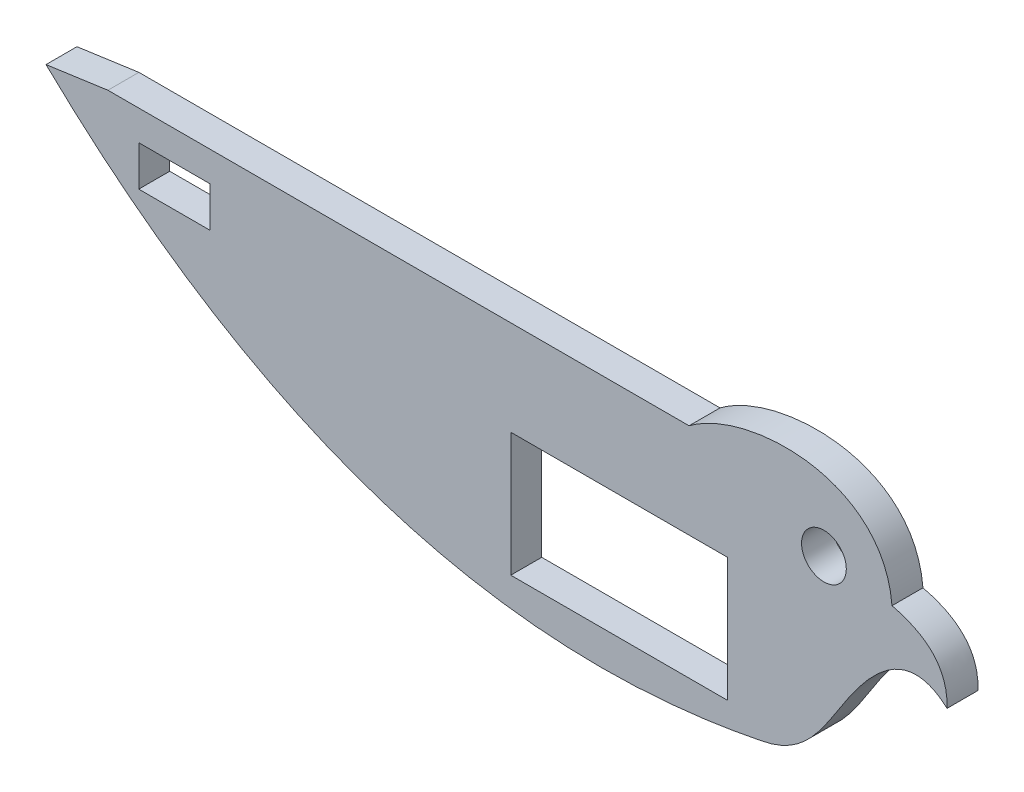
ISO-10303-21;
HEADER;
FILE_DESCRIPTION(('STEP AP214'),'2;1');
FILE_NAME('part.step','',(''),(''),'','','');
FILE_SCHEMA(('AUTOMOTIVE_DESIGN { 1 0 10303 214 1 1 1 1 }'));
ENDSEC;
DATA;
#1=APPLICATION_CONTEXT('core data for automotive mechanical design processes');
#2=APPLICATION_PROTOCOL_DEFINITION('international standard','automotive_design',2000,#1);
#3=PRODUCT_CONTEXT('',#1,'mechanical');
#4=PRODUCT('Part','Part','',(#3));
#5=PRODUCT_RELATED_PRODUCT_CATEGORY('part','',(#4));
#6=PRODUCT_DEFINITION_FORMATION('','',#4);
#7=PRODUCT_DEFINITION_CONTEXT('part definition',#1,'design');
#8=PRODUCT_DEFINITION('design','',#6,#7);
#9=PRODUCT_DEFINITION_SHAPE('','',#8);
#10=(LENGTH_UNIT() NAMED_UNIT(*) SI_UNIT(.MILLI.,.METRE.));
#11=(NAMED_UNIT(*) PLANE_ANGLE_UNIT() SI_UNIT($,.RADIAN.));
#12=(NAMED_UNIT(*) SI_UNIT($,.STERADIAN.) SOLID_ANGLE_UNIT());
#13=UNCERTAINTY_MEASURE_WITH_UNIT(LENGTH_MEASURE(1.E-05),#10,'distance_accuracy_value','');
#14=(GEOMETRIC_REPRESENTATION_CONTEXT(3) GLOBAL_UNCERTAINTY_ASSIGNED_CONTEXT((#13)) GLOBAL_UNIT_ASSIGNED_CONTEXT((#10,
#11,#12)) REPRESENTATION_CONTEXT('',''));
#15=CARTESIAN_POINT('',(0.,0.,0.));
#16=DIRECTION('',(0.,0.,1.));
#17=DIRECTION('',(1.,0.,0.));
#18=AXIS2_PLACEMENT_3D('',#15,#16,#17);
#19=CARTESIAN_POINT('',(161.005913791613,2.48033699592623,5.));
#20=DIRECTION('',(0.,0.,1.));
#21=DIRECTION('',(1.,0.,0.));
#22=AXIS2_PLACEMENT_3D('',#19,#20,#21);
#23=PLANE('',#22);
#24=CARTESIAN_POINT('',(165.191064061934,-10.1776352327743,5.));
#25=CARTESIAN_POINT('',(165.705391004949,5.21885500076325,5.));
#26=CARTESIAN_POINT('',(147.421809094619,9.66127321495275,5.));
#27=B_SPLINE_CURVE_WITH_KNOTS('',2,(#24,#25,#26),.UNSPECIFIED.,.F.,.F.,(3,3),(0.,1.),.UNSPECIFIED.);
#28=CARTESIAN_POINT('',(165.191064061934,-10.1776352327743,5.));
#29=VERTEX_POINT('',#28);
#30=CARTESIAN_POINT('',(147.421809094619,9.66127321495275,5.));
#31=VERTEX_POINT('',#30);
#32=EDGE_CURVE('E240',#29,#31,#27,.T.);
#33=ORIENTED_EDGE('',*,*,#32,.T.);
#34=CARTESIAN_POINT('',(147.421809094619,9.66127321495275,5.));
#35=CARTESIAN_POINT('',(144.59292128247,42.2587609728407,5.));
#36=CARTESIAN_POINT('',(101.517598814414,41.9344295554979,5.));
#37=CARTESIAN_POINT('',(81.8764686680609,27.2192570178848,5.));
#38=B_SPLINE_CURVE_WITH_KNOTS('',3,(#34,#35,#36,#37),.UNSPECIFIED.,.F.,.F.,(4,4),(0.,1.),.UNSPECIFIED.);
#39=CARTESIAN_POINT('',(81.8764686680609,27.2192570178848,5.));
#40=VERTEX_POINT('',#39);
#41=EDGE_CURVE('E247',#31,#40,#38,.T.);
#42=ORIENTED_EDGE('',*,*,#41,.T.);
#43=DIRECTION('',(-1.,0.,0.));
#44=VECTOR('',#43,1.);
#45=CARTESIAN_POINT('',(81.8764686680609,27.2192570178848,5.));
#46=LINE('',#45,#44);
#47=CARTESIAN_POINT('',(-105.830999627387,27.2192570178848,5.));
#48=VERTEX_POINT('',#47);
#49=EDGE_CURVE('E257',#40,#48,#46,.T.);
#50=ORIENTED_EDGE('',*,*,#49,.T.);
#51=DIRECTION('',(-0.990216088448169,-0.139542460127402,0.));
#52=VECTOR('',#51,1.);
#53=CARTESIAN_POINT('',(-125.830999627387,24.4008326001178,5.));
#54=LINE('',#53,#52);
#55=CARTESIAN_POINT('',(-125.830999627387,24.4008326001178,5.));
#56=VERTEX_POINT('',#55);
#57=EDGE_CURVE('E288',#48,#56,#54,.T.);
#58=ORIENTED_EDGE('',*,*,#57,.T.);
#59=CARTESIAN_POINT('',(-125.830999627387,24.4008326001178,5.));
#60=CARTESIAN_POINT('',(-22.4431846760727,-75.1159253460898,5.));
#61=CARTESIAN_POINT('',(105.072009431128,-49.2513335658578,5.));
#62=B_SPLINE_CURVE_WITH_KNOTS('',2,(#59,#60,#61),.UNSPECIFIED.,.F.,.F.,(3,3),(0.,1.),.UNSPECIFIED.);
#63=CARTESIAN_POINT('',(105.072009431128,-49.2513335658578,5.));
#64=VERTEX_POINT('',#63);
#65=EDGE_CURVE('E282',#56,#64,#62,.T.);
#66=ORIENTED_EDGE('',*,*,#65,.T.);
#67=CARTESIAN_POINT('',(105.072009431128,-49.2513335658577,5.));
#68=CARTESIAN_POINT('',(121.64455433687,-46.2763371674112,5.));
#69=CARTESIAN_POINT('',(130.107372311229,-21.4933885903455,5.));
#70=CARTESIAN_POINT('',(153.889230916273,0.0672267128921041,5.));
#71=CARTESIAN_POINT('',(165.191064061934,-10.1776352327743,5.));
#72=B_SPLINE_CURVE_WITH_KNOTS('',3,(#67,#68,#69,#70,#71),.UNSPECIFIED.,.F.,.F.,(4,1,4),(0.,
0.557492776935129,1.),.UNSPECIFIED.);
#73=EDGE_CURVE('E287',#64,#29,#72,.T.);
#74=ORIENTED_EDGE('',*,*,#73,.T.);
#75=EDGE_LOOP('',(#33,#42,#50,#58,#66,#74));
#76=FACE_BOUND('',#75,.T.);
#77=CARTESIAN_POINT('',(125.427279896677,12.544527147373,5.));
#78=DIRECTION('',(0.,0.,1.));
#79=DIRECTION('',(1.,0.,0.));
#80=AXIS2_PLACEMENT_3D('',#77,#78,#79);
#81=CIRCLE('',#80,7.22732478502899);
#82=CARTESIAN_POINT('',(132.654604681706,12.544527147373,5.));
#83=VERTEX_POINT('',#82);
#84=EDGE_CURVE('E233',#83,#83,#81,.T.);
#85=ORIENTED_EDGE('',*,*,#84,.F.);
#86=EDGE_LOOP('',(#85));
#87=FACE_BOUND('',#86,.T.);
#88=DIRECTION('',(-1.,0.,0.));
#89=VECTOR('',#88,1.);
#90=CARTESIAN_POINT('',(-95.8707964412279,17.5349527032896,5.));
#91=LINE('',#90,#89);
#92=CARTESIAN_POINT('',(-72.8707964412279,17.5349527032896,5.));
#93=VERTEX_POINT('',#92);
#94=CARTESIAN_POINT('',(-95.8707964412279,17.5349527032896,5.));
#95=VERTEX_POINT('',#94);
#96=EDGE_CURVE('E193',#93,#95,#91,.T.);
#97=ORIENTED_EDGE('',*,*,#96,.F.);
#98=DIRECTION('',(0.,1.,0.));
#99=VECTOR('',#98,1.);
#100=CARTESIAN_POINT('',(-72.8707964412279,17.5349527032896,5.));
#101=LINE('',#100,#99);
#102=CARTESIAN_POINT('',(-72.8707964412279,4.5349527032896,5.));
#103=VERTEX_POINT('',#102);
#104=EDGE_CURVE('E190',#103,#93,#101,.T.);
#105=ORIENTED_EDGE('',*,*,#104,.F.);
#106=DIRECTION('',(1.,0.,0.));
#107=VECTOR('',#106,1.);
#108=CARTESIAN_POINT('',(-95.8707964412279,4.5349527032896,5.));
#109=LINE('',#108,#107);
#110=CARTESIAN_POINT('',(-95.8707964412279,4.5349527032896,5.));
#111=VERTEX_POINT('',#110);
#112=EDGE_CURVE('E201',#111,#103,#109,.T.);
#113=ORIENTED_EDGE('',*,*,#112,.F.);
#114=DIRECTION('',(0.,-1.,0.));
#115=VECTOR('',#114,1.);
#116=CARTESIAN_POINT('',(-95.8707964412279,17.5349527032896,5.));
#117=LINE('',#116,#115);
#118=EDGE_CURVE('E197',#95,#111,#117,.T.);
#119=ORIENTED_EDGE('',*,*,#118,.F.);
#120=EDGE_LOOP('',(#97,#105,#113,#119));
#121=FACE_BOUND('',#120,.T.);
#122=DIRECTION('',(1.,0.,0.));
#123=VECTOR('',#122,1.);
#124=CARTESIAN_POINT('',(94.2821017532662,-43.3747724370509,5.));
#125=LINE('',#124,#123);
#126=CARTESIAN_POINT('',(24.2821017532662,-43.3747724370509,5.));
#127=VERTEX_POINT('',#126);
#128=CARTESIAN_POINT('',(94.2821017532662,-43.3747724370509,5.));
#129=VERTEX_POINT('',#128);
#130=EDGE_CURVE('E151',#127,#129,#125,.T.);
#131=ORIENTED_EDGE('',*,*,#130,.F.);
#132=DIRECTION('',(0.,-1.,0.));
#133=VECTOR('',#132,1.);
#134=CARTESIAN_POINT('',(24.2821017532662,-43.3747724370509,5.));
#135=LINE('',#134,#133);
#136=CARTESIAN_POINT('',(24.2821017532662,-3.37477243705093,5.));
#137=VERTEX_POINT('',#136);
#138=EDGE_CURVE('E142',#137,#127,#135,.T.);
#139=ORIENTED_EDGE('',*,*,#138,.F.);
#140=DIRECTION('',(-1.,0.,0.));
#141=VECTOR('',#140,1.);
#142=CARTESIAN_POINT('',(94.2821017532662,-3.37477243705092,5.));
#143=LINE('',#142,#141);
#144=CARTESIAN_POINT('',(94.2821017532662,-3.37477243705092,5.));
#145=VERTEX_POINT('',#144);
#146=EDGE_CURVE('E168',#145,#137,#143,.T.);
#147=ORIENTED_EDGE('',*,*,#146,.F.);
#148=DIRECTION('',(0.,1.,0.));
#149=VECTOR('',#148,1.);
#150=CARTESIAN_POINT('',(94.2821017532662,-43.3747724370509,5.));
#151=LINE('',#150,#149);
#152=EDGE_CURVE('E164',#129,#145,#151,.T.);
#153=ORIENTED_EDGE('',*,*,#152,.F.);
#154=EDGE_LOOP('',(#131,#139,#147,#153));
#155=FACE_BOUND('',#154,.T.);
#156=ADVANCED_FACE('F39',(#76,#87,#121,#155),#23,.T.);
#157=CARTESIAN_POINT('',(161.005913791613,2.48033699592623,-5.));
#158=DIRECTION('',(0.,0.,1.));
#159=DIRECTION('',(1.,0.,0.));
#160=AXIS2_PLACEMENT_3D('',#157,#158,#159);
#161=PLANE('',#160);
#162=DIRECTION('',(0.,1.,0.));
#163=VECTOR('',#162,1.);
#164=CARTESIAN_POINT('',(-72.8707964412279,17.5349527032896,-5.));
#165=LINE('',#164,#163);
#166=CARTESIAN_POINT('',(-72.8707964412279,4.5349527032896,-5.));
#167=VERTEX_POINT('',#166);
#168=CARTESIAN_POINT('',(-72.8707964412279,17.5349527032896,-5.));
#169=VERTEX_POINT('',#168);
#170=EDGE_CURVE('E160',#167,#169,#165,.T.);
#171=ORIENTED_EDGE('',*,*,#170,.T.);
#172=DIRECTION('',(-1.,0.,0.));
#173=VECTOR('',#172,1.);
#174=CARTESIAN_POINT('',(-95.8707964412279,17.5349527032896,-5.));
#175=LINE('',#174,#173);
#176=CARTESIAN_POINT('',(-95.8707964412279,17.5349527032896,-5.));
#177=VERTEX_POINT('',#176);
#178=EDGE_CURVE('E208',#169,#177,#175,.T.);
#179=ORIENTED_EDGE('',*,*,#178,.T.);
#180=DIRECTION('',(0.,-1.,0.));
#181=VECTOR('',#180,1.);
#182=CARTESIAN_POINT('',(-95.8707964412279,17.5349527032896,-5.));
#183=LINE('',#182,#181);
#184=CARTESIAN_POINT('',(-95.8707964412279,4.5349527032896,-5.));
#185=VERTEX_POINT('',#184);
#186=EDGE_CURVE('E212',#177,#185,#183,.T.);
#187=ORIENTED_EDGE('',*,*,#186,.T.);
#188=DIRECTION('',(1.,0.,0.));
#189=VECTOR('',#188,1.);
#190=CARTESIAN_POINT('',(-95.8707964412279,4.5349527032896,-5.));
#191=LINE('',#190,#189);
#192=EDGE_CURVE('E194',#185,#167,#191,.T.);
#193=ORIENTED_EDGE('',*,*,#192,.T.);
#194=EDGE_LOOP('',(#171,#179,#187,#193));
#195=FACE_BOUND('',#194,.T.);
#196=CARTESIAN_POINT('',(165.191064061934,-10.1776352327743,-5.));
#197=CARTESIAN_POINT('',(165.705391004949,5.21885500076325,-5.));
#198=CARTESIAN_POINT('',(147.421809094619,9.66127321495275,-5.));
#199=B_SPLINE_CURVE_WITH_KNOTS('',2,(#196,#197,#198),.UNSPECIFIED.,.F.,.F.,(3,3),(0.,1.),.UNSPECIFIED.);
#200=CARTESIAN_POINT('',(165.191064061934,-10.1776352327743,-5.));
#201=VERTEX_POINT('',#200);
#202=CARTESIAN_POINT('',(147.421809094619,9.66127321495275,-5.));
#203=VERTEX_POINT('',#202);
#204=EDGE_CURVE('E237',#201,#203,#199,.T.);
#205=ORIENTED_EDGE('',*,*,#204,.F.);
#206=CARTESIAN_POINT('',(105.072009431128,-49.2513335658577,-5.));
#207=CARTESIAN_POINT('',(121.64455433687,-46.2763371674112,-5.));
#208=CARTESIAN_POINT('',(130.107372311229,-21.4933885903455,-5.));
#209=CARTESIAN_POINT('',(153.889230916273,0.0672267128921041,-5.));
#210=CARTESIAN_POINT('',(165.191064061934,-10.1776352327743,-5.));
#211=B_SPLINE_CURVE_WITH_KNOTS('',3,(#206,#207,#208,#209,#210),.UNSPECIFIED.,.F.,.F.,(4,1,4),
(0.,0.557492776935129,1.),.UNSPECIFIED.);
#212=CARTESIAN_POINT('',(105.072009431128,-49.2513335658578,-5.));
#213=VERTEX_POINT('',#212);
#214=EDGE_CURVE('E248',#213,#201,#211,.T.);
#215=ORIENTED_EDGE('',*,*,#214,.F.);
#216=CARTESIAN_POINT('',(-125.830999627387,24.4008326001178,-5.));
#217=CARTESIAN_POINT('',(-22.4431846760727,-75.1159253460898,-5.));
#218=CARTESIAN_POINT('',(105.072009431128,-49.2513335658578,-5.));
#219=B_SPLINE_CURVE_WITH_KNOTS('',2,(#216,#217,#218),.UNSPECIFIED.,.F.,.F.,(3,3),(0.,1.),.UNSPECIFIED.);
#220=CARTESIAN_POINT('',(-125.830999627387,24.4008326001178,-5.));
#221=VERTEX_POINT('',#220);
#222=EDGE_CURVE('E323',#221,#213,#219,.T.);
#223=ORIENTED_EDGE('',*,*,#222,.F.);
#224=DIRECTION('',(-0.990216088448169,-0.139542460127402,0.));
#225=VECTOR('',#224,1.);
#226=CARTESIAN_POINT('',(-125.830999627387,24.4008326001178,-5.));
#227=LINE('',#226,#225);
#228=CARTESIAN_POINT('',(-105.830999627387,27.2192570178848,-5.));
#229=VERTEX_POINT('',#228);
#230=EDGE_CURVE('E320',#229,#221,#227,.T.);
#231=ORIENTED_EDGE('',*,*,#230,.F.);
#232=DIRECTION('',(-1.,0.,0.));
#233=VECTOR('',#232,1.);
#234=CARTESIAN_POINT('',(81.8764686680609,27.2192570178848,-5.));
#235=LINE('',#234,#233);
#236=CARTESIAN_POINT('',(81.8764686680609,27.2192570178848,-5.));
#237=VERTEX_POINT('',#236);
#238=EDGE_CURVE('E314',#237,#229,#235,.T.);
#239=ORIENTED_EDGE('',*,*,#238,.F.);
#240=CARTESIAN_POINT('',(147.421809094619,9.66127321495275,-5.));
#241=CARTESIAN_POINT('',(144.59292128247,42.2587609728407,-5.));
#242=CARTESIAN_POINT('',(101.517598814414,41.9344295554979,-5.));
#243=CARTESIAN_POINT('',(81.8764686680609,27.2192570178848,-5.));
#244=B_SPLINE_CURVE_WITH_KNOTS('',3,(#240,#241,#242,#243),.UNSPECIFIED.,.F.,.F.,(4,4),(0.,1.),.UNSPECIFIED.);
#245=EDGE_CURVE('E306',#203,#237,#244,.T.);
#246=ORIENTED_EDGE('',*,*,#245,.F.);
#247=EDGE_LOOP('',(#205,#215,#223,#231,#239,#246));
#248=FACE_BOUND('',#247,.T.);
#249=CARTESIAN_POINT('',(125.427279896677,12.544527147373,-5.));
#250=DIRECTION('',(0.,0.,1.));
#251=DIRECTION('',(1.,0.,0.));
#252=AXIS2_PLACEMENT_3D('',#249,#250,#251);
#253=CIRCLE('',#252,7.22732478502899);
#254=CARTESIAN_POINT('',(132.654604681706,12.544527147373,-5.));
#255=VERTEX_POINT('',#254);
#256=EDGE_CURVE('E232',#255,#255,#253,.T.);
#257=ORIENTED_EDGE('',*,*,#256,.T.);
#258=EDGE_LOOP('',(#257));
#259=FACE_BOUND('',#258,.T.);
#260=DIRECTION('',(0.,-1.,0.));
#261=VECTOR('',#260,1.);
#262=CARTESIAN_POINT('',(24.2821017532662,-43.3747724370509,-5.));
#263=LINE('',#262,#261);
#264=CARTESIAN_POINT('',(24.2821017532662,-3.37477243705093,-5.));
#265=VERTEX_POINT('',#264);
#266=CARTESIAN_POINT('',(24.2821017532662,-43.3747724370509,-5.));
#267=VERTEX_POINT('',#266);
#268=EDGE_CURVE('E64',#265,#267,#263,.T.);
#269=ORIENTED_EDGE('',*,*,#268,.T.);
#270=DIRECTION('',(1.,0.,0.));
#271=VECTOR('',#270,1.);
#272=CARTESIAN_POINT('',(94.2821017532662,-43.3747724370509,-5.));
#273=LINE('',#272,#271);
#274=CARTESIAN_POINT('',(94.2821017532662,-43.3747724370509,-5.));
#275=VERTEX_POINT('',#274);
#276=EDGE_CURVE('E158',#267,#275,#273,.T.);
#277=ORIENTED_EDGE('',*,*,#276,.T.);
#278=DIRECTION('',(0.,1.,0.));
#279=VECTOR('',#278,1.);
#280=CARTESIAN_POINT('',(94.2821017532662,-43.3747724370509,-5.));
#281=LINE('',#280,#279);
#282=CARTESIAN_POINT('',(94.2821017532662,-3.37477243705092,-5.));
#283=VERTEX_POINT('',#282);
#284=EDGE_CURVE('E177',#275,#283,#281,.T.);
#285=ORIENTED_EDGE('',*,*,#284,.T.);
#286=DIRECTION('',(-1.,0.,0.));
#287=VECTOR('',#286,1.);
#288=CARTESIAN_POINT('',(94.2821017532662,-3.37477243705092,-5.));
#289=LINE('',#288,#287);
#290=EDGE_CURVE('E152',#283,#265,#289,.T.);
#291=ORIENTED_EDGE('',*,*,#290,.T.);
#292=EDGE_LOOP('',(#269,#277,#285,#291));
#293=FACE_BOUND('',#292,.T.);
#294=ADVANCED_FACE('F361',(#195,#248,#259,#293),#161,.F.);
#295=DIRECTION('',(0.,0.,-1.));
#296=VECTOR('',#295,1.);
#297=SURFACE_OF_LINEAR_EXTRUSION('',#27,#296);
#298=ORIENTED_EDGE('',*,*,#204,.T.);
#299=DIRECTION('',(0.,0.,-1.));
#300=VECTOR('',#299,1.);
#301=CARTESIAN_POINT('',(147.421809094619,9.66127321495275,5.));
#302=LINE('',#301,#300);
#303=EDGE_CURVE('E11',#31,#203,#302,.T.);
#304=ORIENTED_EDGE('',*,*,#303,.F.);
#305=ORIENTED_EDGE('',*,*,#32,.F.);
#306=DIRECTION('',(0.,0.,-1.));
#307=VECTOR('',#306,1.);
#308=CARTESIAN_POINT('',(165.191064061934,-10.1776352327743,5.));
#309=LINE('',#308,#307);
#310=EDGE_CURVE('E297',#29,#201,#309,.T.);
#311=ORIENTED_EDGE('',*,*,#310,.T.);
#312=EDGE_LOOP('',(#298,#304,#305,#311));
#313=FACE_BOUND('',#312,.T.);
#314=ADVANCED_FACE('F41',(#313),#297,.F.);
#315=DIRECTION('',(0.,0.,-1.));
#316=VECTOR('',#315,1.);
#317=SURFACE_OF_LINEAR_EXTRUSION('',#38,#316);
#318=ORIENTED_EDGE('',*,*,#245,.T.);
#319=DIRECTION('',(0.,0.,-1.));
#320=VECTOR('',#319,1.);
#321=CARTESIAN_POINT('',(81.8764686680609,27.2192570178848,5.));
#322=LINE('',#321,#320);
#323=EDGE_CURVE('E49',#40,#237,#322,.T.);
#324=ORIENTED_EDGE('',*,*,#323,.F.);
#325=ORIENTED_EDGE('',*,*,#41,.F.);
#326=ORIENTED_EDGE('',*,*,#303,.T.);
#327=EDGE_LOOP('',(#318,#324,#325,#326));
#328=FACE_BOUND('',#327,.T.);
#329=ADVANCED_FACE('F262',(#328),#317,.F.);
#330=CARTESIAN_POINT('',(81.8764686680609,27.2192570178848,5.));
#331=DIRECTION('',(0.,-1.,0.));
#332=DIRECTION('',(1.,0.,0.));
#333=AXIS2_PLACEMENT_3D('',#330,#331,#332);
#334=PLANE('',#333);
#335=ORIENTED_EDGE('',*,*,#238,.T.);
#336=DIRECTION('',(0.,0.,-1.));
#337=VECTOR('',#336,1.);
#338=CARTESIAN_POINT('',(-105.830999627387,27.2192570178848,5.));
#339=LINE('',#338,#337);
#340=EDGE_CURVE('E349',#48,#229,#339,.T.);
#341=ORIENTED_EDGE('',*,*,#340,.F.);
#342=ORIENTED_EDGE('',*,*,#49,.F.);
#343=ORIENTED_EDGE('',*,*,#323,.T.);
#344=EDGE_LOOP('',(#335,#341,#342,#343));
#345=FACE_BOUND('',#344,.T.);
#346=ADVANCED_FACE('F265',(#345),#334,.F.);
#347=CARTESIAN_POINT('',(-125.830999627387,24.4008326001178,5.));
#348=DIRECTION('',(0.139542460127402,-0.990216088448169,0.));
#349=DIRECTION('',(0.990216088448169,0.139542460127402,0.));
#350=AXIS2_PLACEMENT_3D('',#347,#348,#349);
#351=PLANE('',#350);
#352=ORIENTED_EDGE('',*,*,#230,.T.);
#353=DIRECTION('',(0.,0.,-1.));
#354=VECTOR('',#353,1.);
#355=CARTESIAN_POINT('',(-125.830999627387,24.4008326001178,5.));
#356=LINE('',#355,#354);
#357=EDGE_CURVE('E345',#56,#221,#356,.T.);
#358=ORIENTED_EDGE('',*,*,#357,.F.);
#359=ORIENTED_EDGE('',*,*,#57,.F.);
#360=ORIENTED_EDGE('',*,*,#340,.T.);
#361=EDGE_LOOP('',(#352,#358,#359,#360));
#362=FACE_BOUND('',#361,.T.);
#363=ADVANCED_FACE('F269',(#362),#351,.F.);
#364=DIRECTION('',(0.,0.,-1.));
#365=VECTOR('',#364,1.);
#366=SURFACE_OF_LINEAR_EXTRUSION('',#62,#365);
#367=ORIENTED_EDGE('',*,*,#222,.T.);
#368=DIRECTION('',(0.,0.,-1.));
#369=VECTOR('',#368,1.);
#370=CARTESIAN_POINT('',(105.072009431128,-49.2513335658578,5.));
#371=LINE('',#370,#369);
#372=EDGE_CURVE('E341',#64,#213,#371,.T.);
#373=ORIENTED_EDGE('',*,*,#372,.F.);
#374=ORIENTED_EDGE('',*,*,#65,.F.);
#375=ORIENTED_EDGE('',*,*,#357,.T.);
#376=EDGE_LOOP('',(#367,#373,#374,#375));
#377=FACE_BOUND('',#376,.T.);
#378=ADVANCED_FACE('F273',(#377),#366,.F.);
#379=DIRECTION('',(0.,0.,-1.));
#380=VECTOR('',#379,1.);
#381=SURFACE_OF_LINEAR_EXTRUSION('',#72,#380);
#382=ORIENTED_EDGE('',*,*,#214,.T.);
#383=ORIENTED_EDGE('',*,*,#310,.F.);
#384=ORIENTED_EDGE('',*,*,#73,.F.);
#385=ORIENTED_EDGE('',*,*,#372,.T.);
#386=EDGE_LOOP('',(#382,#383,#384,#385));
#387=FACE_BOUND('',#386,.T.);
#388=ADVANCED_FACE('F278',(#387),#381,.F.);
#389=CARTESIAN_POINT('',(125.427279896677,12.544527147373,5.));
#390=DIRECTION('',(0.,0.,-1.));
#391=DIRECTION('',(-1.,0.,0.));
#392=AXIS2_PLACEMENT_3D('',#389,#390,#391);
#393=CYLINDRICAL_SURFACE('',#392,7.22732478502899);
#394=ORIENTED_EDGE('',*,*,#84,.T.);
#395=EDGE_LOOP('',(#394));
#396=FACE_BOUND('',#395,.T.);
#397=ORIENTED_EDGE('',*,*,#256,.F.);
#398=EDGE_LOOP('',(#397));
#399=FACE_BOUND('',#398,.T.);
#400=ADVANCED_FACE('F380',(#396,#399),#393,.F.);
#401=CARTESIAN_POINT('',(-72.8707964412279,17.5349527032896,5.));
#402=DIRECTION('',(-1.,0.,0.));
#403=DIRECTION('',(0.,-1.,0.));
#404=AXIS2_PLACEMENT_3D('',#401,#402,#403);
#405=PLANE('',#404);
#406=ORIENTED_EDGE('',*,*,#170,.F.);
#407=DIRECTION('',(0.,0.,-1.));
#408=VECTOR('',#407,1.);
#409=CARTESIAN_POINT('',(-72.8707964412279,4.5349527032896,5.));
#410=LINE('',#409,#408);
#411=EDGE_CURVE('E204',#103,#167,#410,.T.);
#412=ORIENTED_EDGE('',*,*,#411,.F.);
#413=ORIENTED_EDGE('',*,*,#104,.T.);
#414=DIRECTION('',(0.,0.,-1.));
#415=VECTOR('',#414,1.);
#416=CARTESIAN_POINT('',(-72.8707964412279,17.5349527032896,5.));
#417=LINE('',#416,#415);
#418=EDGE_CURVE('E228',#93,#169,#417,.T.);
#419=ORIENTED_EDGE('',*,*,#418,.T.);
#420=EDGE_LOOP('',(#406,#412,#413,#419));
#421=FACE_BOUND('',#420,.T.);
#422=ADVANCED_FACE('F384',(#421),#405,.T.);
#423=CARTESIAN_POINT('',(-95.8707964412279,17.5349527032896,5.));
#424=DIRECTION('',(0.,-1.,0.));
#425=DIRECTION('',(0.,0.,-1.));
#426=AXIS2_PLACEMENT_3D('',#423,#424,#425);
#427=PLANE('',#426);
#428=ORIENTED_EDGE('',*,*,#178,.F.);
#429=ORIENTED_EDGE('',*,*,#418,.F.);
#430=ORIENTED_EDGE('',*,*,#96,.T.);
#431=DIRECTION('',(0.,0.,-1.));
#432=VECTOR('',#431,1.);
#433=CARTESIAN_POINT('',(-95.8707964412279,17.5349527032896,5.));
#434=LINE('',#433,#432);
#435=EDGE_CURVE('E225',#95,#177,#434,.T.);
#436=ORIENTED_EDGE('',*,*,#435,.T.);
#437=EDGE_LOOP('',(#428,#429,#430,#436));
#438=FACE_BOUND('',#437,.T.);
#439=ADVANCED_FACE('F396',(#438),#427,.T.);
#440=CARTESIAN_POINT('',(-95.8707964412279,17.5349527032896,5.));
#441=DIRECTION('',(1.,0.,0.));
#442=DIRECTION('',(0.,0.,-1.));
#443=AXIS2_PLACEMENT_3D('',#440,#441,#442);
#444=PLANE('',#443);
#445=ORIENTED_EDGE('',*,*,#186,.F.);
#446=ORIENTED_EDGE('',*,*,#435,.F.);
#447=ORIENTED_EDGE('',*,*,#118,.T.);
#448=DIRECTION('',(0.,0.,-1.));
#449=VECTOR('',#448,1.);
#450=CARTESIAN_POINT('',(-95.8707964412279,4.5349527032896,5.));
#451=LINE('',#450,#449);
#452=EDGE_CURVE('E222',#111,#185,#451,.T.);
#453=ORIENTED_EDGE('',*,*,#452,.T.);
#454=EDGE_LOOP('',(#445,#446,#447,#453));
#455=FACE_BOUND('',#454,.T.);
#456=ADVANCED_FACE('F400',(#455),#444,.T.);
#457=CARTESIAN_POINT('',(-95.8707964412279,4.5349527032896,5.));
#458=DIRECTION('',(0.,1.,0.));
#459=DIRECTION('',(0.,0.,1.));
#460=AXIS2_PLACEMENT_3D('',#457,#458,#459);
#461=PLANE('',#460);
#462=ORIENTED_EDGE('',*,*,#192,.F.);
#463=ORIENTED_EDGE('',*,*,#452,.F.);
#464=ORIENTED_EDGE('',*,*,#112,.T.);
#465=ORIENTED_EDGE('',*,*,#411,.T.);
#466=EDGE_LOOP('',(#462,#463,#464,#465));
#467=FACE_BOUND('',#466,.T.);
#468=ADVANCED_FACE('F404',(#467),#461,.T.);
#469=CARTESIAN_POINT('',(24.2821017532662,-43.3747724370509,5.));
#470=DIRECTION('',(1.,0.,0.));
#471=DIRECTION('',(0.,0.,-1.));
#472=AXIS2_PLACEMENT_3D('',#469,#470,#471);
#473=PLANE('',#472);
#474=ORIENTED_EDGE('',*,*,#268,.F.);
#475=DIRECTION('',(0.,0.,-1.));
#476=VECTOR('',#475,1.);
#477=CARTESIAN_POINT('',(24.2821017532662,-3.37477243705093,5.));
#478=LINE('',#477,#476);
#479=EDGE_CURVE('E146',#137,#265,#478,.T.);
#480=ORIENTED_EDGE('',*,*,#479,.F.);
#481=ORIENTED_EDGE('',*,*,#138,.T.);
#482=DIRECTION('',(0.,0.,-1.));
#483=VECTOR('',#482,1.);
#484=CARTESIAN_POINT('',(24.2821017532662,-43.3747724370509,5.));
#485=LINE('',#484,#483);
#486=EDGE_CURVE('E145',#127,#267,#485,.T.);
#487=ORIENTED_EDGE('',*,*,#486,.T.);
#488=EDGE_LOOP('',(#474,#480,#481,#487));
#489=FACE_BOUND('',#488,.T.);
#490=ADVANCED_FACE('F144',(#489),#473,.T.);
#491=CARTESIAN_POINT('',(94.2821017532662,-43.3747724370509,5.));
#492=DIRECTION('',(0.,1.,0.));
#493=DIRECTION('',(-1.,0.,0.));
#494=AXIS2_PLACEMENT_3D('',#491,#492,#493);
#495=PLANE('',#494);
#496=ORIENTED_EDGE('',*,*,#276,.F.);
#497=ORIENTED_EDGE('',*,*,#486,.F.);
#498=ORIENTED_EDGE('',*,*,#130,.T.);
#499=DIRECTION('',(0.,0.,-1.));
#500=VECTOR('',#499,1.);
#501=CARTESIAN_POINT('',(94.2821017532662,-43.3747724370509,5.));
#502=LINE('',#501,#500);
#503=EDGE_CURVE('E161',#129,#275,#502,.T.);
#504=ORIENTED_EDGE('',*,*,#503,.T.);
#505=EDGE_LOOP('',(#496,#497,#498,#504));
#506=FACE_BOUND('',#505,.T.);
#507=ADVANCED_FACE('F155',(#506),#495,.T.);
#508=CARTESIAN_POINT('',(94.2821017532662,-43.3747724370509,5.));
#509=DIRECTION('',(-1.,0.,0.));
#510=DIRECTION('',(0.,0.,1.));
#511=AXIS2_PLACEMENT_3D('',#508,#509,#510);
#512=PLANE('',#511);
#513=ORIENTED_EDGE('',*,*,#284,.F.);
#514=ORIENTED_EDGE('',*,*,#503,.F.);
#515=ORIENTED_EDGE('',*,*,#152,.T.);
#516=DIRECTION('',(0.,0.,-1.));
#517=VECTOR('',#516,1.);
#518=CARTESIAN_POINT('',(94.2821017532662,-3.37477243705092,5.));
#519=LINE('',#518,#517);
#520=EDGE_CURVE('E56',#145,#283,#519,.T.);
#521=ORIENTED_EDGE('',*,*,#520,.T.);
#522=EDGE_LOOP('',(#513,#514,#515,#521));
#523=FACE_BOUND('',#522,.T.);
#524=ADVANCED_FACE('F413',(#523),#512,.T.);
#525=CARTESIAN_POINT('',(94.2821017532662,-3.37477243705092,5.));
#526=DIRECTION('',(0.,-1.,0.));
#527=DIRECTION('',(1.,0.,0.));
#528=AXIS2_PLACEMENT_3D('',#525,#526,#527);
#529=PLANE('',#528);
#530=ORIENTED_EDGE('',*,*,#290,.F.);
#531=ORIENTED_EDGE('',*,*,#520,.F.);
#532=ORIENTED_EDGE('',*,*,#146,.T.);
#533=ORIENTED_EDGE('',*,*,#479,.T.);
#534=EDGE_LOOP('',(#530,#531,#532,#533));
#535=FACE_BOUND('',#534,.T.);
#536=ADVANCED_FACE('F416',(#535),#529,.T.);
#537=CLOSED_SHELL('',(#156,#294,#314,#329,#346,#363,#378,#388,#400,#422,#439,#456,#468,#490,
#507,#524,#536));
#538=MANIFOLD_SOLID_BREP('B2',#537);
#539=ADVANCED_BREP_SHAPE_REPRESENTATION('',(#18,#538),#14);
#540=SHAPE_DEFINITION_REPRESENTATION(#9,#539);
ENDSEC;
END-ISO-10303-21;
